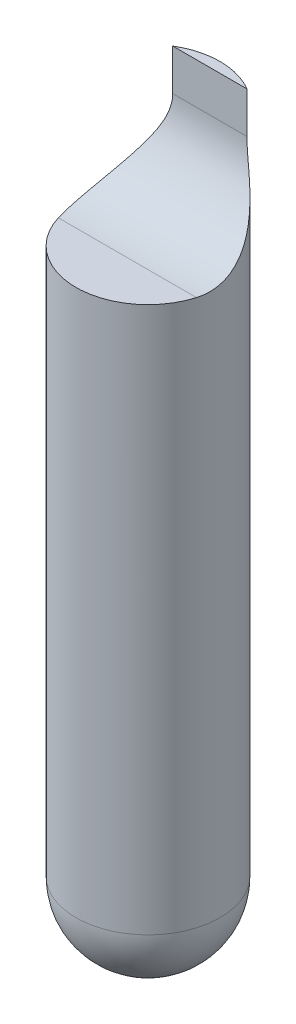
from build123d import *

# Parameters (mm, degrees)
SKETCH2_R               = 44.45
BOSS_EXTRUDE1_DEPTH     = 457.2
FILLET1_R               = 44.45
CUT_EXTRUDE1_DEPTH      = 462.501294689
CUT_EXTRUDE1_DEPTH_BACK = 462.501294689


with BuildPart() as part:
    # Sketch2 → Boss-Extrude1 (new body)
    with BuildSketch(Plane(origin=(0, 0, 0), x_dir=(1, 0, 0), z_dir=(0, 1, 0))):
        with Locations(Location((0, 0, 0), (0, 0, 270))):
            Circle(SKETCH2_R)
    extrude(amount=BOSS_EXTRUDE1_DEPTH)

    # Fillet1
    fillet1_edges = [part.edges().sort_by_distance(p)[0] for p in [
        (0, 0, -44.45),
    ]]
    fillet(fillet1_edges, radius=FILLET1_R)

    # Sketch3 → Cut-Extrude1 (cut, two sides: drawn at the far end of the back side and taken through both)
    with BuildSketch(Plane.ZY.offset(-CUT_EXTRUDE1_DEPTH_BACK)):
        with BuildLine():
            Line((-38.1, 431.8), (-38.1, 457.2))
            Line((-38.1, 457.2), (12.7, 457.2))
            Line((12.7, 457.2), (56.533985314, 457.2))
            Line((56.533985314, 457.2), (56.533985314, 381))
            Line((56.533985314, 381), (12.7, 381))
            ThreePointArc((12.7, 381), (-23.221024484, 395.878975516), (-38.1, 431.8))
        make_face()
    extrude(amount=CUT_EXTRUDE1_DEPTH + CUT_EXTRUDE1_DEPTH_BACK, mode=Mode.SUBTRACT)


solid = part.part
